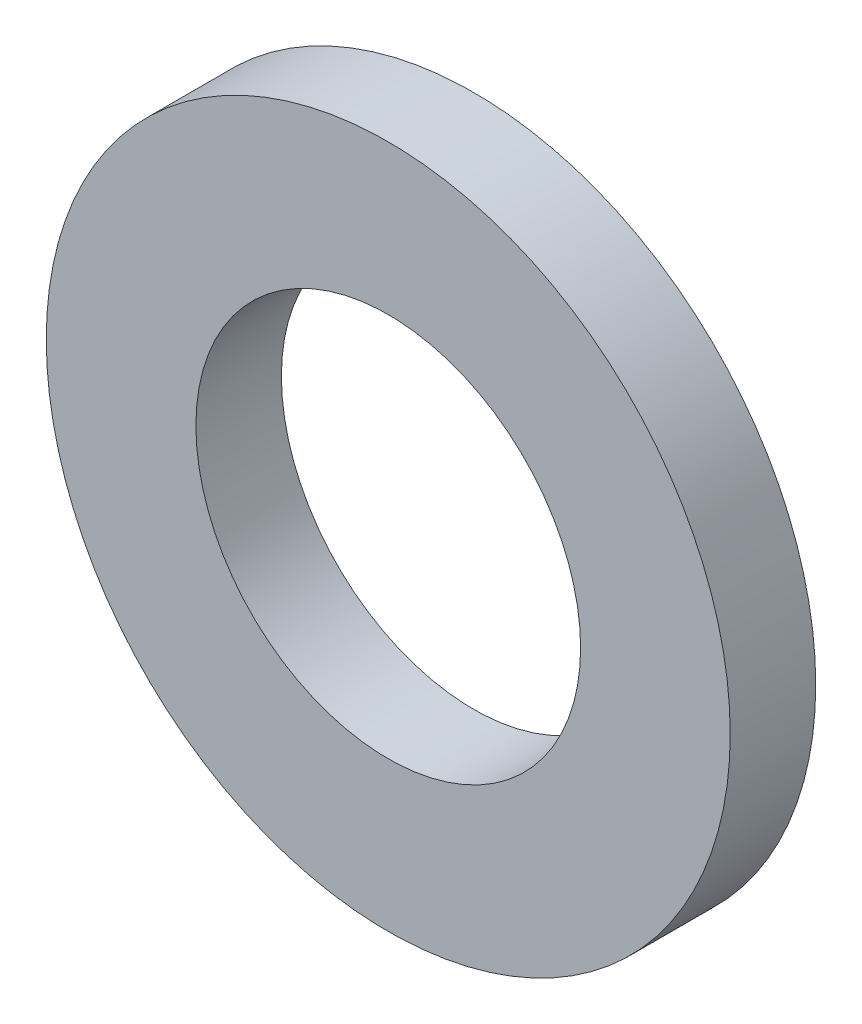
ISO-10303-21;
HEADER;
FILE_DESCRIPTION(('STEP AP214'),'2;1');
FILE_NAME('part.step','',(''),(''),'','','');
FILE_SCHEMA(('AUTOMOTIVE_DESIGN { 1 0 10303 214 1 1 1 1 }'));
ENDSEC;
DATA;
#1=APPLICATION_CONTEXT('core data for automotive mechanical design processes');
#2=APPLICATION_PROTOCOL_DEFINITION('international standard','automotive_design',2000,#1);
#3=PRODUCT_CONTEXT('',#1,'mechanical');
#4=PRODUCT('Part','Part','',(#3));
#5=PRODUCT_RELATED_PRODUCT_CATEGORY('part','',(#4));
#6=PRODUCT_DEFINITION_FORMATION('','',#4);
#7=PRODUCT_DEFINITION_CONTEXT('part definition',#1,'design');
#8=PRODUCT_DEFINITION('design','',#6,#7);
#9=PRODUCT_DEFINITION_SHAPE('','',#8);
#10=(LENGTH_UNIT() NAMED_UNIT(*) SI_UNIT(.MILLI.,.METRE.));
#11=(NAMED_UNIT(*) PLANE_ANGLE_UNIT() SI_UNIT($,.RADIAN.));
#12=(NAMED_UNIT(*) SI_UNIT($,.STERADIAN.) SOLID_ANGLE_UNIT());
#13=UNCERTAINTY_MEASURE_WITH_UNIT(LENGTH_MEASURE(1.E-05),#10,'distance_accuracy_value','');
#14=(GEOMETRIC_REPRESENTATION_CONTEXT(3) GLOBAL_UNCERTAINTY_ASSIGNED_CONTEXT((#13)) GLOBAL_UNIT_ASSIGNED_CONTEXT((#10,
#11,#12)) REPRESENTATION_CONTEXT('',''));
#15=CARTESIAN_POINT('',(0.,0.,0.));
#16=DIRECTION('',(0.,0.,1.));
#17=DIRECTION('',(1.,0.,0.));
#18=AXIS2_PLACEMENT_3D('',#15,#16,#17);
#19=CARTESIAN_POINT('',(0.,0.,2.));
#20=DIRECTION('',(0.,0.,1.));
#21=DIRECTION('',(1.,0.,0.));
#22=AXIS2_PLACEMENT_3D('',#19,#20,#21);
#23=PLANE('',#22);
#24=CARTESIAN_POINT('',(0.,0.,2.));
#25=DIRECTION('',(0.,0.,1.));
#26=DIRECTION('',(1.,0.,0.));
#27=AXIS2_PLACEMENT_3D('',#24,#25,#26);
#28=CIRCLE('',#27,8.);
#29=CARTESIAN_POINT('',(8.,0.,2.));
#30=VERTEX_POINT('',#29);
#31=EDGE_CURVE('E10',#30,#30,#28,.T.);
#32=ORIENTED_EDGE('',*,*,#31,.T.);
#33=EDGE_LOOP('',(#32));
#34=FACE_BOUND('',#33,.T.);
#35=CARTESIAN_POINT('',(0.,0.,2.));
#36=DIRECTION('',(0.,0.,1.));
#37=DIRECTION('',(1.,0.,0.));
#38=AXIS2_PLACEMENT_3D('',#35,#36,#37);
#39=CIRCLE('',#38,4.5);
#40=CARTESIAN_POINT('',(4.5,0.,2.));
#41=VERTEX_POINT('',#40);
#42=EDGE_CURVE('E36',#41,#41,#39,.T.);
#43=ORIENTED_EDGE('',*,*,#42,.F.);
#44=EDGE_LOOP('',(#43));
#45=FACE_BOUND('',#44,.T.);
#46=ADVANCED_FACE('F25',(#34,#45),#23,.T.);
#47=CARTESIAN_POINT('',(0.,0.,0.));
#48=DIRECTION('',(0.,0.,1.));
#49=DIRECTION('',(1.,0.,0.));
#50=AXIS2_PLACEMENT_3D('',#47,#48,#49);
#51=PLANE('',#50);
#52=CARTESIAN_POINT('',(0.,0.,0.));
#53=DIRECTION('',(0.,0.,1.));
#54=DIRECTION('',(1.,0.,0.));
#55=AXIS2_PLACEMENT_3D('',#52,#53,#54);
#56=CIRCLE('',#55,8.);
#57=CARTESIAN_POINT('',(8.,0.,0.));
#58=VERTEX_POINT('',#57);
#59=EDGE_CURVE('E32',#58,#58,#56,.T.);
#60=ORIENTED_EDGE('',*,*,#59,.F.);
#61=EDGE_LOOP('',(#60));
#62=FACE_BOUND('',#61,.T.);
#63=CARTESIAN_POINT('',(0.,0.,0.));
#64=DIRECTION('',(0.,0.,1.));
#65=DIRECTION('',(1.,0.,0.));
#66=AXIS2_PLACEMENT_3D('',#63,#64,#65);
#67=CIRCLE('',#66,4.5);
#68=CARTESIAN_POINT('',(4.5,0.,0.));
#69=VERTEX_POINT('',#68);
#70=EDGE_CURVE('E40',#69,#69,#67,.T.);
#71=ORIENTED_EDGE('',*,*,#70,.T.);
#72=EDGE_LOOP('',(#71));
#73=FACE_BOUND('',#72,.T.);
#74=ADVANCED_FACE('F46',(#62,#73),#51,.F.);
#75=CARTESIAN_POINT('',(0.,0.,2.));
#76=DIRECTION('',(0.,0.,-1.));
#77=DIRECTION('',(-1.,0.,0.));
#78=AXIS2_PLACEMENT_3D('',#75,#76,#77);
#79=CYLINDRICAL_SURFACE('',#78,8.);
#80=ORIENTED_EDGE('',*,*,#31,.F.);
#81=EDGE_LOOP('',(#80));
#82=FACE_BOUND('',#81,.T.);
#83=ORIENTED_EDGE('',*,*,#59,.T.);
#84=EDGE_LOOP('',(#83));
#85=FACE_BOUND('',#84,.T.);
#86=ADVANCED_FACE('F27',(#82,#85),#79,.T.);
#87=CARTESIAN_POINT('',(0.,0.,2.));
#88=DIRECTION('',(0.,0.,-1.));
#89=DIRECTION('',(-1.,0.,0.));
#90=AXIS2_PLACEMENT_3D('',#87,#88,#89);
#91=CYLINDRICAL_SURFACE('',#90,4.5);
#92=ORIENTED_EDGE('',*,*,#42,.T.);
#93=EDGE_LOOP('',(#92));
#94=FACE_BOUND('',#93,.T.);
#95=ORIENTED_EDGE('',*,*,#70,.F.);
#96=EDGE_LOOP('',(#95));
#97=FACE_BOUND('',#96,.T.);
#98=ADVANCED_FACE('F48',(#94,#97),#91,.F.);
#99=CLOSED_SHELL('',(#46,#74,#86,#98));
#100=MANIFOLD_SOLID_BREP('B2',#99);
#101=ADVANCED_BREP_SHAPE_REPRESENTATION('',(#18,#100),#14);
#102=SHAPE_DEFINITION_REPRESENTATION(#9,#101);
ENDSEC;
END-ISO-10303-21;
